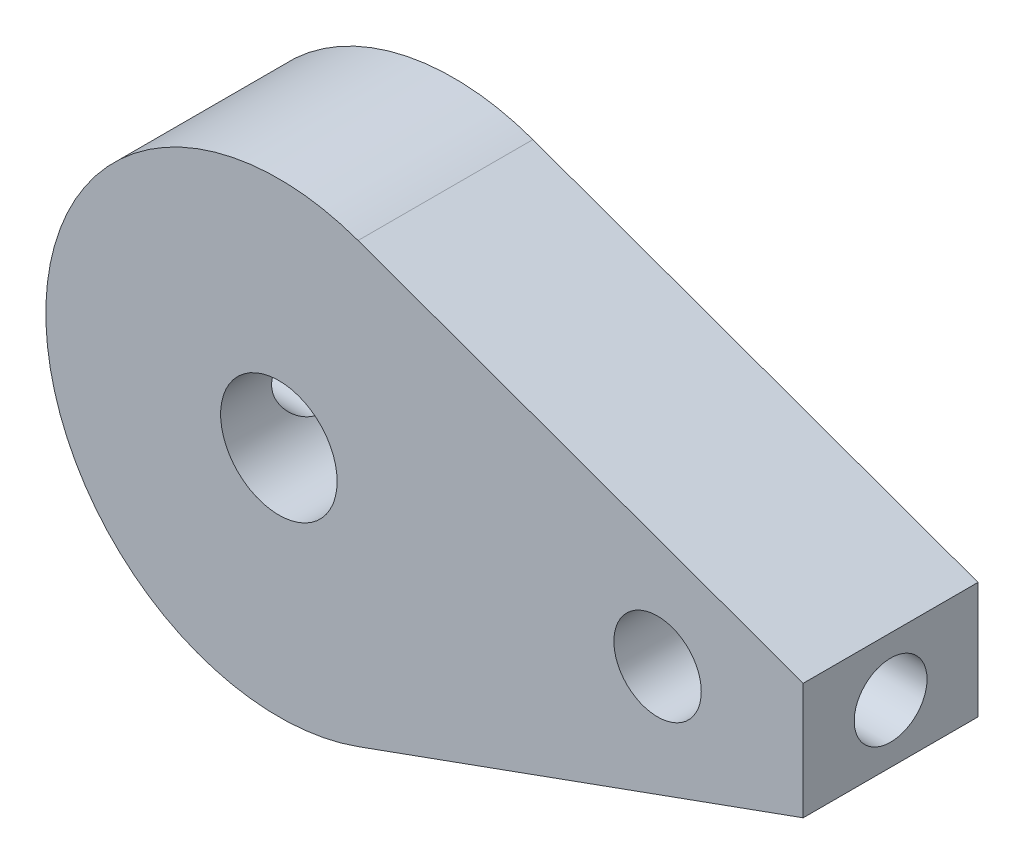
ISO-10303-21;
HEADER;
FILE_DESCRIPTION(('STEP AP214'),'2;1');
FILE_NAME('part.step','',(''),(''),'','','');
FILE_SCHEMA(('AUTOMOTIVE_DESIGN { 1 0 10303 214 1 1 1 1 }'));
ENDSEC;
DATA;
#1=APPLICATION_CONTEXT('core data for automotive mechanical design processes');
#2=APPLICATION_PROTOCOL_DEFINITION('international standard','automotive_design',2000,#1);
#3=PRODUCT_CONTEXT('',#1,'mechanical');
#4=PRODUCT('Part','Part','',(#3));
#5=PRODUCT_RELATED_PRODUCT_CATEGORY('part','',(#4));
#6=PRODUCT_DEFINITION_FORMATION('','',#4);
#7=PRODUCT_DEFINITION_CONTEXT('part definition',#1,'design');
#8=PRODUCT_DEFINITION('design','',#6,#7);
#9=PRODUCT_DEFINITION_SHAPE('','',#8);
#10=(LENGTH_UNIT() NAMED_UNIT(*) SI_UNIT(.MILLI.,.METRE.));
#11=(NAMED_UNIT(*) PLANE_ANGLE_UNIT() SI_UNIT($,.RADIAN.));
#12=(NAMED_UNIT(*) SI_UNIT($,.STERADIAN.) SOLID_ANGLE_UNIT());
#13=UNCERTAINTY_MEASURE_WITH_UNIT(LENGTH_MEASURE(1.E-05),#10,'distance_accuracy_value','');
#14=(GEOMETRIC_REPRESENTATION_CONTEXT(3) GLOBAL_UNCERTAINTY_ASSIGNED_CONTEXT((#13)) GLOBAL_UNIT_ASSIGNED_CONTEXT((#10,
#11,#12)) REPRESENTATION_CONTEXT('',''));
#15=CARTESIAN_POINT('',(0.,0.,0.));
#16=DIRECTION('',(0.,0.,1.));
#17=DIRECTION('',(1.,0.,0.));
#18=AXIS2_PLACEMENT_3D('',#15,#16,#17);
#19=CARTESIAN_POINT('',(-18.,0.,6.));
#20=DIRECTION('',(0.,0.,1.));
#21=DIRECTION('',(1.,0.,0.));
#22=AXIS2_PLACEMENT_3D('',#19,#20,#21);
#23=PLANE('',#22);
#24=CARTESIAN_POINT('',(-18.,0.,6.));
#25=DIRECTION('',(0.,0.,1.));
#26=DIRECTION('',(1.,0.,0.));
#27=AXIS2_PLACEMENT_3D('',#24,#25,#26);
#28=CIRCLE('',#27,2.);
#29=CARTESIAN_POINT('',(-16.,0.,6.));
#30=VERTEX_POINT('',#29);
#31=EDGE_CURVE('E104',#30,#30,#28,.T.);
#32=ORIENTED_EDGE('',*,*,#31,.F.);
#33=EDGE_LOOP('',(#32));
#34=FACE_BOUND('',#33,.T.);
#35=CARTESIAN_POINT('',(-18.,0.,6.));
#36=DIRECTION('',(0.,0.,1.));
#37=DIRECTION('',(1.,0.,0.));
#38=AXIS2_PLACEMENT_3D('',#35,#36,#37);
#39=CIRCLE('',#38,8.);
#40=CARTESIAN_POINT('',(-15.2803939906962,7.52354591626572,6.));
#41=VERTEX_POINT('',#40);
#42=CARTESIAN_POINT('',(-15.2803939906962,-7.52354591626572,6.));
#43=VERTEX_POINT('',#42);
#44=EDGE_CURVE('E89',#41,#43,#39,.T.);
#45=ORIENTED_EDGE('',*,*,#44,.T.);
#46=DIRECTION('',(0.940443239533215,0.339950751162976,0.));
#47=VECTOR('',#46,1.);
#48=CARTESIAN_POINT('',(0.,-2.,6.));
#49=LINE('',#48,#47);
#50=CARTESIAN_POINT('',(0.,-2.,6.));
#51=VERTEX_POINT('',#50);
#52=EDGE_CURVE('E84',#43,#51,#49,.T.);
#53=ORIENTED_EDGE('',*,*,#52,.T.);
#54=DIRECTION('',(0.,1.,0.));
#55=VECTOR('',#54,1.);
#56=CARTESIAN_POINT('',(0.,-2.,6.));
#57=LINE('',#56,#55);
#58=CARTESIAN_POINT('',(0.,2.,6.));
#59=VERTEX_POINT('',#58);
#60=EDGE_CURVE('E87',#51,#59,#57,.T.);
#61=ORIENTED_EDGE('',*,*,#60,.T.);
#62=DIRECTION('',(-0.940443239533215,0.339950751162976,0.));
#63=VECTOR('',#62,1.);
#64=CARTESIAN_POINT('',(0.,2.,6.));
#65=LINE('',#64,#63);
#66=EDGE_CURVE('E54',#59,#41,#65,.T.);
#67=ORIENTED_EDGE('',*,*,#66,.T.);
#68=EDGE_LOOP('',(#45,#53,#61,#67));
#69=FACE_BOUND('',#68,.T.);
#70=CARTESIAN_POINT('',(-5.,0.,6.));
#71=DIRECTION('',(0.,0.,1.));
#72=DIRECTION('',(1.,0.,0.));
#73=AXIS2_PLACEMENT_3D('',#70,#71,#72);
#74=CIRCLE('',#73,1.5);
#75=CARTESIAN_POINT('',(-3.5,0.,6.));
#76=VERTEX_POINT('',#75);
#77=EDGE_CURVE('E119',#76,#76,#74,.T.);
#78=ORIENTED_EDGE('',*,*,#77,.F.);
#79=EDGE_LOOP('',(#78));
#80=FACE_BOUND('',#79,.T.);
#81=ADVANCED_FACE('F36',(#34,#69,#80),#23,.T.);
#82=CARTESIAN_POINT('',(-18.,0.,0.));
#83=DIRECTION('',(0.,0.,1.));
#84=DIRECTION('',(1.,0.,0.));
#85=AXIS2_PLACEMENT_3D('',#82,#83,#84);
#86=PLANE('',#85);
#87=CARTESIAN_POINT('',(-18.,0.,0.));
#88=DIRECTION('',(0.,0.,1.));
#89=DIRECTION('',(1.,0.,0.));
#90=AXIS2_PLACEMENT_3D('',#87,#88,#89);
#91=CIRCLE('',#90,8.);
#92=CARTESIAN_POINT('',(-15.2803939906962,7.52354591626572,0.));
#93=VERTEX_POINT('',#92);
#94=CARTESIAN_POINT('',(-15.2803939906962,-7.52354591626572,0.));
#95=VERTEX_POINT('',#94);
#96=EDGE_CURVE('E101',#93,#95,#91,.T.);
#97=ORIENTED_EDGE('',*,*,#96,.F.);
#98=DIRECTION('',(-0.940443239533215,0.339950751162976,0.));
#99=VECTOR('',#98,1.);
#100=CARTESIAN_POINT('',(0.,2.,0.));
#101=LINE('',#100,#99);
#102=CARTESIAN_POINT('',(0.,2.,0.));
#103=VERTEX_POINT('',#102);
#104=EDGE_CURVE('E77',#103,#93,#101,.T.);
#105=ORIENTED_EDGE('',*,*,#104,.F.);
#106=DIRECTION('',(0.,1.,0.));
#107=VECTOR('',#106,1.);
#108=CARTESIAN_POINT('',(0.,-2.,0.));
#109=LINE('',#108,#107);
#110=CARTESIAN_POINT('',(0.,-2.,0.));
#111=VERTEX_POINT('',#110);
#112=EDGE_CURVE('E71',#111,#103,#109,.T.);
#113=ORIENTED_EDGE('',*,*,#112,.F.);
#114=DIRECTION('',(0.940443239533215,0.339950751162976,0.));
#115=VECTOR('',#114,1.);
#116=CARTESIAN_POINT('',(0.,-2.,0.));
#117=LINE('',#116,#115);
#118=EDGE_CURVE('E93',#95,#111,#117,.T.);
#119=ORIENTED_EDGE('',*,*,#118,.F.);
#120=EDGE_LOOP('',(#97,#105,#113,#119));
#121=FACE_BOUND('',#120,.T.);
#122=CARTESIAN_POINT('',(-18.,0.,0.));
#123=DIRECTION('',(0.,0.,1.));
#124=DIRECTION('',(1.,0.,0.));
#125=AXIS2_PLACEMENT_3D('',#122,#123,#124);
#126=CIRCLE('',#125,2.);
#127=CARTESIAN_POINT('',(-16.,0.,0.));
#128=VERTEX_POINT('',#127);
#129=EDGE_CURVE('E116',#128,#128,#126,.T.);
#130=ORIENTED_EDGE('',*,*,#129,.T.);
#131=EDGE_LOOP('',(#130));
#132=FACE_BOUND('',#131,.T.);
#133=CARTESIAN_POINT('',(-5.,0.,0.));
#134=DIRECTION('',(0.,0.,1.));
#135=DIRECTION('',(1.,0.,0.));
#136=AXIS2_PLACEMENT_3D('',#133,#134,#135);
#137=CIRCLE('',#136,1.5);
#138=CARTESIAN_POINT('',(-3.5,0.,0.));
#139=VERTEX_POINT('',#138);
#140=EDGE_CURVE('E122',#139,#139,#137,.T.);
#141=ORIENTED_EDGE('',*,*,#140,.T.);
#142=EDGE_LOOP('',(#141));
#143=FACE_BOUND('',#142,.T.);
#144=ADVANCED_FACE('F112',(#121,#132,#143),#86,.F.);
#145=CARTESIAN_POINT('',(-18.,0.,6.));
#146=DIRECTION('',(0.,0.,-1.));
#147=DIRECTION('',(-1.,0.,0.));
#148=AXIS2_PLACEMENT_3D('',#145,#146,#147);
#149=CYLINDRICAL_SURFACE('',#148,8.);
#150=CARTESIAN_POINT('',(-26.,0.,4.24999999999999));
#151=CARTESIAN_POINT('',(-25.9999988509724,-0.0697575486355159,4.24999715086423));
#152=CARTESIAN_POINT('',(-25.9990780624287,-0.139554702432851,4.24414094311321));
#153=CARTESIAN_POINT('',(-25.995493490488,-0.277195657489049,4.22087815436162));
#154=CARTESIAN_POINT('',(-25.9928280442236,-0.345037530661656,4.20346055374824));
#155=CARTESIAN_POINT('',(-25.9860534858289,-0.476756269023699,4.15761016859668));
#156=CARTESIAN_POINT('',(-25.9819454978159,-0.540636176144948,4.12918595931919));
#157=CARTESIAN_POINT('',(-25.9727389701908,-0.662710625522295,4.06215072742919));
#158=CARTESIAN_POINT('',(-25.9676405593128,-0.720905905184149,4.02354102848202));
#159=CARTESIAN_POINT('',(-25.9569713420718,-0.830459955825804,3.93688347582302));
#160=CARTESIAN_POINT('',(-25.9513972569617,-0.881763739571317,3.88876650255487));
#161=CARTESIAN_POINT('',(-25.9404303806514,-0.975603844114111,3.78460902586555));
#162=CARTESIAN_POINT('',(-25.9350376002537,-1.01813964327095,3.7285680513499));
#163=CARTESIAN_POINT('',(-25.9250121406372,-1.09345272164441,3.60978086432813));
#164=CARTESIAN_POINT('',(-25.9203836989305,-1.12617636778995,3.5470002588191));
#165=CARTESIAN_POINT('',(-25.9124560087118,-1.18059340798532,3.4167492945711));
#166=CARTESIAN_POINT('',(-25.9091566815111,-1.20228745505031,3.34927921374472));
#167=CARTESIAN_POINT('',(-25.9042931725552,-1.23385779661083,3.21214454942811));
#168=CARTESIAN_POINT('',(-25.9027151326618,-1.24382852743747,3.1425022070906));
#169=CARTESIAN_POINT('',(-25.9014308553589,-1.2519618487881,3.00251640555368));
#170=CARTESIAN_POINT('',(-25.9017245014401,-1.25012517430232,2.93217299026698));
#171=CARTESIAN_POINT('',(-25.904137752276,-1.23477290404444,2.79345148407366));
#172=CARTESIAN_POINT('',(-25.9062408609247,-1.22136281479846,2.72506138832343));
#173=CARTESIAN_POINT('',(-25.9120102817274,-1.18340968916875,2.59151399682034));
#174=CARTESIAN_POINT('',(-25.9156766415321,-1.15886631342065,2.52635679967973));
#175=CARTESIAN_POINT('',(-25.9241775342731,-1.09923458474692,2.40080564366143));
#176=CARTESIAN_POINT('',(-25.9290169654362,-1.06410186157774,2.34043310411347));
#177=CARTESIAN_POINT('',(-25.9393152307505,-0.98432029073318,2.22640023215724));
#178=CARTESIAN_POINT('',(-25.9447741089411,-0.939670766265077,2.17274037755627));
#179=CARTESIAN_POINT('',(-25.9557689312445,-0.841545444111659,2.07304487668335));
#180=CARTESIAN_POINT('',(-25.961305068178,-0.787979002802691,2.02709842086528));
#181=CARTESIAN_POINT('',(-25.9717756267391,-0.673848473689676,1.94483342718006));
#182=CARTESIAN_POINT('',(-25.9767100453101,-0.613284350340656,1.90851493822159));
#183=CARTESIAN_POINT('',(-25.9854269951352,-0.486797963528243,1.84653096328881));
#184=CARTESIAN_POINT('',(-25.9892087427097,-0.420872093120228,1.82087272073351));
#185=CARTESIAN_POINT('',(-25.9951878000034,-0.285574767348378,1.78101701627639));
#186=CARTESIAN_POINT('',(-25.9973852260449,-0.216203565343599,1.76681871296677));
#187=CARTESIAN_POINT('',(-25.9999325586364,-0.0767541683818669,1.75040536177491));
#188=CARTESIAN_POINT('',(-26.0003013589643,-0.00669073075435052,1.74806776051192));
#189=CARTESIAN_POINT('',(-25.9992014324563,0.132827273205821,1.755116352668));
#190=CARTESIAN_POINT('',(-25.9977327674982,0.202281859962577,1.76450215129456));
#191=CARTESIAN_POINT('',(-25.9931346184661,0.33823672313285,1.7946291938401));
#192=CARTESIAN_POINT('',(-25.9900139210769,0.404750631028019,1.81531037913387));
#193=CARTESIAN_POINT('',(-25.9824603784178,0.53336703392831,1.8673775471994));
#194=CARTESIAN_POINT('',(-25.9780274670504,0.5954693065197,1.89876406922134));
#195=CARTESIAN_POINT('',(-25.9682948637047,0.7140361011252,1.97163599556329));
#196=CARTESIAN_POINT('',(-25.9629886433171,0.770452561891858,2.01319871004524));
#197=CARTESIAN_POINT('',(-25.9521194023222,0.875553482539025,2.1051360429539));
#198=CARTESIAN_POINT('',(-25.9465563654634,0.924237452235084,2.15551121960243));
#199=CARTESIAN_POINT('',(-25.9357401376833,1.01294040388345,2.26419059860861));
#200=CARTESIAN_POINT('',(-25.930490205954,1.05287699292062,2.32256242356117));
#201=CARTESIAN_POINT('',(-25.9209534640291,1.1223778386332,2.44525803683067));
#202=CARTESIAN_POINT('',(-25.91666662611,1.15194239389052,2.50958165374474));
#203=CARTESIAN_POINT('',(-25.9095653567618,1.19973385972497,2.6421148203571));
#204=CARTESIAN_POINT('',(-25.9067454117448,1.21800327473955,2.71030873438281));
#205=CARTESIAN_POINT('',(-25.902882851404,1.24282061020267,2.84884457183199));
#206=CARTESIAN_POINT('',(-25.9018401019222,1.24936941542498,2.9191863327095));
#207=CARTESIAN_POINT('',(-25.9016552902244,1.25053726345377,3.05919935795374));
#208=CARTESIAN_POINT('',(-25.9024925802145,1.24528590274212,3.12886954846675));
#209=CARTESIAN_POINT('',(-25.9059284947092,1.2232811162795,3.26632264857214));
#210=CARTESIAN_POINT('',(-25.9085271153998,1.2065277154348,3.33410556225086));
#211=CARTESIAN_POINT('',(-25.9151854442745,1.16204164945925,3.46581891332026));
#212=CARTESIAN_POINT('',(-25.919243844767,1.1343188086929,3.5297527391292));
#213=CARTESIAN_POINT('',(-25.928365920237,1.06869384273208,3.65208280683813));
#214=CARTESIAN_POINT('',(-25.9334296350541,1.03079131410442,3.71047882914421));
#215=CARTESIAN_POINT('',(-25.9440578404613,0.945415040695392,3.82073277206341));
#216=CARTESIAN_POINT('',(-25.9496270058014,0.897845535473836,3.87251609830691));
#217=CARTESIAN_POINT('',(-25.9606002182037,0.794687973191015,3.96741061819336));
#218=CARTESIAN_POINT('',(-25.9660042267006,0.739098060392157,4.01051979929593));
#219=CARTESIAN_POINT('',(-25.9760755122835,0.621083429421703,4.08707561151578));
#220=CARTESIAN_POINT('',(-25.9807381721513,0.558619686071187,4.1204626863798));
#221=CARTESIAN_POINT('',(-25.9887562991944,0.428925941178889,4.17622049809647));
#222=CARTESIAN_POINT('',(-25.9921131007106,0.361700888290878,4.19860248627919));
#223=CARTESIAN_POINT('',(-25.9963872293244,0.245157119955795,4.22671651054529));
#224=CARTESIAN_POINT('',(-25.9977349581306,0.19655278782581,4.23543424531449));
#225=CARTESIAN_POINT('',(-25.9995417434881,0.0986388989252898,4.24707695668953));
#226=CARTESIAN_POINT('',(-26.0000008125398,0.0493293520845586,4.25000201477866));
#227=CARTESIAN_POINT('',(-26.,0.,4.24999999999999));
#228=B_SPLINE_CURVE_WITH_KNOTS('',3,(#150,#151,#152,#153,#154,#155,#156,#157,#158,#159,#160,
#161,#162,#163,#164,#165,#166,#167,#168,#169,#170,#171,#172,#173,#174,#175,#176,#177,#178,#179,
#180,#181,#182,#183,#184,#185,#186,#187,#188,#189,#190,#191,#192,#193,#194,#195,#196,#197,#198,
#199,#200,#201,#202,#203,#204,#205,#206,#207,#208,#209,#210,#211,#212,#213,#214,#215,#216,#217,
#218,#219,#220,#221,#222,#223,#224,#225,#226,#227),.UNSPECIFIED.,.T.,.F.,(4,2,2,2,2,2,2,2,2,2,2,
2,2,2,2,2,2,2,2,2,2,2,2,2,2,2,2,2,2,2,2,2,2,2,2,2,2,2,4),(0.,0.209092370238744,
0.418384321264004,0.62751353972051,0.836615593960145,1.04729784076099,1.2579926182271,
1.46981889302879,1.68163262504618,1.89172815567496,2.10181060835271,2.30999788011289,
2.51819149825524,2.72726988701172,2.93636314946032,3.14772866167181,3.35909524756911,
3.5706052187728,3.78209965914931,3.99140427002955,4.20070183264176,4.40889722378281,
4.61710310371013,4.82694270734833,5.03679560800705,5.24854740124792,5.46029309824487,
5.67123705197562,5.88216508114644,6.09078790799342,6.29941028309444,6.50784623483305,
6.7162904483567,6.92691006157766,7.13757848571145,7.34951152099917,7.56122742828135,
7.70909008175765,7.8569506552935),.UNSPECIFIED.);
#229=CARTESIAN_POINT('',(-26.,0.,4.24999999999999));
#230=VERTEX_POINT('',#229);
#231=EDGE_CURVE('E153',#230,#230,#228,.T.);
#232=ORIENTED_EDGE('',*,*,#231,.T.);
#233=EDGE_LOOP('',(#232));
#234=FACE_BOUND('',#233,.T.);
#235=ORIENTED_EDGE('',*,*,#96,.T.);
#236=DIRECTION('',(0.,0.,-1.));
#237=VECTOR('',#236,1.);
#238=CARTESIAN_POINT('',(-15.2803939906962,-7.52354591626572,6.));
#239=LINE('',#238,#237);
#240=EDGE_CURVE('E11',#43,#95,#239,.T.);
#241=ORIENTED_EDGE('',*,*,#240,.F.);
#242=ORIENTED_EDGE('',*,*,#44,.F.);
#243=DIRECTION('',(0.,0.,-1.));
#244=VECTOR('',#243,1.);
#245=CARTESIAN_POINT('',(-15.2803939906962,7.52354591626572,6.));
#246=LINE('',#245,#244);
#247=EDGE_CURVE('E97',#41,#93,#246,.T.);
#248=ORIENTED_EDGE('',*,*,#247,.T.);
#249=EDGE_LOOP('',(#235,#241,#242,#248));
#250=FACE_BOUND('',#249,.T.);
#251=ADVANCED_FACE('F38',(#234,#250),#149,.T.);
#252=CARTESIAN_POINT('',(0.,-2.,6.));
#253=DIRECTION('',(-0.339950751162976,0.940443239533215,0.));
#254=DIRECTION('',(-0.940443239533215,-0.339950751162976,0.));
#255=AXIS2_PLACEMENT_3D('',#252,#253,#254);
#256=PLANE('',#255);
#257=ORIENTED_EDGE('',*,*,#118,.T.);
#258=DIRECTION('',(0.,0.,-1.));
#259=VECTOR('',#258,1.);
#260=CARTESIAN_POINT('',(0.,-2.,6.));
#261=LINE('',#260,#259);
#262=EDGE_CURVE('E46',#51,#111,#261,.T.);
#263=ORIENTED_EDGE('',*,*,#262,.F.);
#264=ORIENTED_EDGE('',*,*,#52,.F.);
#265=ORIENTED_EDGE('',*,*,#240,.T.);
#266=EDGE_LOOP('',(#257,#263,#264,#265));
#267=FACE_BOUND('',#266,.T.);
#268=ADVANCED_FACE('F92',(#267),#256,.F.);
#269=CARTESIAN_POINT('',(0.,-2.,6.));
#270=DIRECTION('',(-1.,0.,0.));
#271=DIRECTION('',(0.,0.,1.));
#272=AXIS2_PLACEMENT_3D('',#269,#270,#271);
#273=PLANE('',#272);
#274=CARTESIAN_POINT('',(0.,0.,3.));
#275=DIRECTION('',(1.,0.,0.));
#276=DIRECTION('',(0.,0.,-1.));
#277=AXIS2_PLACEMENT_3D('',#274,#275,#276);
#278=CIRCLE('',#277,1.24999999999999);
#279=CARTESIAN_POINT('',(0.,0.,1.75000000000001));
#280=VERTEX_POINT('',#279);
#281=EDGE_CURVE('E134',#280,#280,#278,.T.);
#282=ORIENTED_EDGE('',*,*,#281,.F.);
#283=EDGE_LOOP('',(#282));
#284=FACE_BOUND('',#283,.T.);
#285=ORIENTED_EDGE('',*,*,#112,.T.);
#286=DIRECTION('',(0.,0.,-1.));
#287=VECTOR('',#286,1.);
#288=CARTESIAN_POINT('',(0.,2.,6.));
#289=LINE('',#288,#287);
#290=EDGE_CURVE('E94',#59,#103,#289,.T.);
#291=ORIENTED_EDGE('',*,*,#290,.F.);
#292=ORIENTED_EDGE('',*,*,#60,.F.);
#293=ORIENTED_EDGE('',*,*,#262,.T.);
#294=EDGE_LOOP('',(#285,#291,#292,#293));
#295=FACE_BOUND('',#294,.T.);
#296=ADVANCED_FACE('F95',(#284,#295),#273,.F.);
#297=CARTESIAN_POINT('',(0.,2.,6.));
#298=DIRECTION('',(-0.339950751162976,-0.940443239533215,0.));
#299=DIRECTION('',(0.940443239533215,-0.339950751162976,0.));
#300=AXIS2_PLACEMENT_3D('',#297,#298,#299);
#301=PLANE('',#300);
#302=ORIENTED_EDGE('',*,*,#104,.T.);
#303=ORIENTED_EDGE('',*,*,#247,.F.);
#304=ORIENTED_EDGE('',*,*,#66,.F.);
#305=ORIENTED_EDGE('',*,*,#290,.T.);
#306=EDGE_LOOP('',(#302,#303,#304,#305));
#307=FACE_BOUND('',#306,.T.);
#308=ADVANCED_FACE('F109',(#307),#301,.F.);
#309=CARTESIAN_POINT('',(-18.,0.,6.));
#310=DIRECTION('',(0.,0.,-1.));
#311=DIRECTION('',(-1.,0.,0.));
#312=AXIS2_PLACEMENT_3D('',#309,#310,#311);
#313=CYLINDRICAL_SURFACE('',#312,2.);
#314=CARTESIAN_POINT('',(-20.,0.,4.24999999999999));
#315=CARTESIAN_POINT('',(-19.9999959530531,-0.0635104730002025,4.24999565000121));
#316=CARTESIAN_POINT('',(-19.99694323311,-0.127096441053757,4.24512698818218));
#317=CARTESIAN_POINT('',(-19.985021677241,-0.252318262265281,4.22591419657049));
#318=CARTESIAN_POINT('',(-19.976141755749,-0.313950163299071,4.21155200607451));
#319=CARTESIAN_POINT('',(-19.9534585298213,-0.433205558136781,4.17418863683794));
#320=CARTESIAN_POINT('',(-19.9396796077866,-0.490847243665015,4.15123021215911));
#321=CARTESIAN_POINT('',(-19.9083459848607,-0.601260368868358,4.09761414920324));
#322=CARTESIAN_POINT('',(-19.8907917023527,-0.654032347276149,4.0669573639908));
#323=CARTESIAN_POINT('',(-19.8517015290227,-0.757974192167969,3.99611342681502));
#324=CARTESIAN_POINT('',(-19.8299596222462,-0.808679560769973,3.95536070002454));
#325=CARTESIAN_POINT('',(-19.7853134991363,-0.902986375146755,3.86678082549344));
#326=CARTESIAN_POINT('',(-19.7624077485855,-0.946578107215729,3.81894417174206));
#327=CARTESIAN_POINT('',(-19.714304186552,-1.03142873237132,3.70996610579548));
#328=CARTESIAN_POINT('',(-19.6892161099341,-1.0715720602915,3.64790021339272));
#329=CARTESIAN_POINT('',(-19.6433019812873,-1.14073966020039,3.51643518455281));
#330=CARTESIAN_POINT('',(-19.6224687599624,-1.16978270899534,3.44704868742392));
#331=CARTESIAN_POINT('',(-19.5930957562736,-1.2093340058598,3.32118947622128));
#332=CARTESIAN_POINT('',(-19.5827690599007,-1.22269552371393,3.26603318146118));
#333=CARTESIAN_POINT('',(-19.5678135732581,-1.24181843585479,3.1536940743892));
#334=CARTESIAN_POINT('',(-19.5631767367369,-1.24759056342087,3.09651424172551));
#335=CARTESIAN_POINT('',(-19.5602988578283,-1.25118918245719,2.98158698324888));
#336=CARTESIAN_POINT('',(-19.5620745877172,-1.2489948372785,2.9238384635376));
#337=CARTESIAN_POINT('',(-19.5717740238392,-1.23676317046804,2.80968989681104));
#338=CARTESIAN_POINT('',(-19.5797026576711,-1.22671956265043,2.75329096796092));
#339=CARTESIAN_POINT('',(-19.6003257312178,-1.19968103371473,2.64456154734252));
#340=CARTESIAN_POINT('',(-19.6129071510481,-1.18285016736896,2.59216754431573));
#341=CARTESIAN_POINT('',(-19.6414556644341,-1.14290189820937,2.49083881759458));
#342=CARTESIAN_POINT('',(-19.6574239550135,-1.11978227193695,2.4419053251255));
#343=CARTESIAN_POINT('',(-19.6945481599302,-1.06294892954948,2.33916672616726));
#344=CARTESIAN_POINT('',(-19.7161159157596,-1.0280629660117,2.28615918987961));
#345=CARTESIAN_POINT('',(-19.7600571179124,-0.950881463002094,2.18616972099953));
#346=CARTESIAN_POINT('',(-19.7824313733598,-0.908578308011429,2.13919406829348));
#347=CARTESIAN_POINT('',(-19.8297989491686,-0.809519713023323,2.04469825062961));
#348=CARTESIAN_POINT('',(-19.8546153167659,-0.751531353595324,1.99836702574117));
#349=CARTESIAN_POINT('',(-19.9002805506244,-0.62714809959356,1.91614910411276));
#350=CARTESIAN_POINT('',(-19.9211309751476,-0.56075652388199,1.88025830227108));
#351=CARTESIAN_POINT('',(-19.9555337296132,-0.42488356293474,1.82223631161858));
#352=CARTESIAN_POINT('',(-19.9694197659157,-0.355763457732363,1.79946596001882));
#353=CARTESIAN_POINT('',(-19.9898492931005,-0.213612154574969,1.76623507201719));
#354=CARTESIAN_POINT('',(-19.9964031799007,-0.140586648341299,1.755757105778));
#355=CARTESIAN_POINT('',(-20.0009784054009,-0.00451561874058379,1.74843414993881));
#356=CARTESIAN_POINT('',(-20.0001216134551,0.0584027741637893,1.74979682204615));
#357=CARTESIAN_POINT('',(-19.9925890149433,0.182972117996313,1.76188282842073));
#358=CARTESIAN_POINT('',(-19.9859136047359,0.244623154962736,1.77260552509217));
#359=CARTESIAN_POINT('',(-19.9677405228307,0.362521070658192,1.80223853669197));
#360=CARTESIAN_POINT('',(-19.9564417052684,0.418885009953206,1.82081215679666));
#361=CARTESIAN_POINT('',(-19.9299568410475,0.52763828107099,1.86529638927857));
#362=CARTESIAN_POINT('',(-19.9147701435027,0.580026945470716,1.89120823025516));
#363=CARTESIAN_POINT('',(-19.87990012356,0.685084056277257,1.95251520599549));
#364=CARTESIAN_POINT('',(-19.8599176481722,0.737246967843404,1.98860356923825));
#365=CARTESIAN_POINT('',(-19.8180697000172,0.835142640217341,2.06779386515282));
#366=CARTESIAN_POINT('',(-19.7962021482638,0.880868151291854,2.11090358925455));
#367=CARTESIAN_POINT('',(-19.7490586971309,0.971474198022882,2.21013503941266));
#368=CARTESIAN_POINT('',(-19.7237488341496,1.01526851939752,2.26723720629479));
#369=CARTESIAN_POINT('',(-19.6756676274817,1.09280351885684,2.38887578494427));
#370=CARTESIAN_POINT('',(-19.6528945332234,1.12655115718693,2.453407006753));
#371=CARTESIAN_POINT('',(-19.6173353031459,1.17684772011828,2.57469214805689));
#372=CARTESIAN_POINT('',(-19.6034563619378,1.19551895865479,2.63024075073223));
#373=CARTESIAN_POINT('',(-19.5810503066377,1.22500108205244,2.74439314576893));
#374=CARTESIAN_POINT('',(-19.5725148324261,1.23582424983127,2.80299200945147));
#375=CARTESIAN_POINT('',(-19.5620632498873,1.24901383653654,2.9220902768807));
#376=CARTESIAN_POINT('',(-19.5601850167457,1.25133186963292,2.98259858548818));
#377=CARTESIAN_POINT('',(-19.5634906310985,1.24719778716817,3.10313096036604));
#378=CARTESIAN_POINT('',(-19.5686768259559,1.24074275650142,3.16315485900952));
#379=CARTESIAN_POINT('',(-19.5845538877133,1.22038272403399,3.27602979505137));
#380=CARTESIAN_POINT('',(-19.5947680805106,1.20711919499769,3.32906930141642));
#381=CARTESIAN_POINT('',(-19.6191753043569,1.17417623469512,3.43213505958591));
#382=CARTESIAN_POINT('',(-19.6333699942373,1.15449412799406,3.48216004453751));
#383=CARTESIAN_POINT('',(-19.6666390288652,1.10602690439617,3.5855967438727));
#384=CARTESIAN_POINT('',(-19.68612230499,1.07633644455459,3.63845029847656));
#385=CARTESIAN_POINT('',(-19.7266770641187,1.01000017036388,3.73893836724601));
#386=CARTESIAN_POINT('',(-19.7477498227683,0.973348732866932,3.78656861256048));
#387=CARTESIAN_POINT('',(-19.7940191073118,0.885670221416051,3.88501425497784));
#388=CARTESIAN_POINT('',(-19.8192054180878,0.833233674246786,3.93459084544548));
#389=CARTESIAN_POINT('',(-19.8669872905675,0.719822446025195,4.02449482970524));
#390=CARTESIAN_POINT('',(-19.8895812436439,0.65884251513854,4.0648164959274));
#391=CARTESIAN_POINT('',(-19.9298671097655,0.529355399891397,4.1347711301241));
#392=CARTESIAN_POINT('',(-19.9475507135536,0.46083572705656,4.16438600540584));
#393=CARTESIAN_POINT('',(-19.9758152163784,0.31839471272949,4.21107188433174));
#394=CARTESIAN_POINT('',(-19.9864212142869,0.244493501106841,4.22818723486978));
#395=CARTESIAN_POINT('',(-19.9951947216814,0.141418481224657,4.24229920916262));
#396=CARTESIAN_POINT('',(-19.996991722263,0.113248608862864,4.24518186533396));
#397=CARTESIAN_POINT('',(-19.9993953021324,0.0567241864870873,4.2490332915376));
#398=CARTESIAN_POINT('',(-20.0000018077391,0.0283696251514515,4.25000194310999));
#399=CARTESIAN_POINT('',(-20.,0.,4.24999999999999));
#400=B_SPLINE_CURVE_WITH_KNOTS('',3,(#314,#315,#316,#317,#318,#319,#320,#321,#322,#323,#324,
#325,#326,#327,#328,#329,#330,#331,#332,#333,#334,#335,#336,#337,#338,#339,#340,#341,#342,#343,
#344,#345,#346,#347,#348,#349,#350,#351,#352,#353,#354,#355,#356,#357,#358,#359,#360,#361,#362,
#363,#364,#365,#366,#367,#368,#369,#370,#371,#372,#373,#374,#375,#376,#377,#378,#379,#380,#381,
#382,#383,#384,#385,#386,#387,#388,#389,#390,#391,#392,#393,#394,#395,#396,#397,#398,#399),
.UNSPECIFIED.,.T.,.F.,(4,2,2,2,2,2,2,2,2,2,2,2,2,2,2,2,2,2,2,2,2,2,2,2,2,2,2,2,2,2,2,2,2,2,2,2,
2,2,2,2,2,2,4),(0.,0.190412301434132,0.38118789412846,0.571026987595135,0.760845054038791,
0.965821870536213,1.17107628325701,1.40412975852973,1.6367872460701,1.80912008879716,
1.9812089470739,2.15374823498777,2.32642584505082,2.49515839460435,2.66395067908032,
2.86427450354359,3.06480522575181,3.2984218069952,3.5319464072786,3.75284174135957,
3.97342347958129,4.16127180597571,4.34910733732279,4.52959504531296,4.71011298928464,
4.9088523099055,5.10781368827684,5.33565708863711,5.56334227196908,5.74329940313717,
5.9229742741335,6.10366974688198,6.28442527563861,6.45063169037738,6.61690747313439,
6.80725523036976,6.99775741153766,7.22600539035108,7.45439424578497,7.68316725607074,
7.91112460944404,7.99617501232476,8.08123067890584),.UNSPECIFIED.);
#401=CARTESIAN_POINT('',(-20.,0.,4.24999999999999));
#402=VERTEX_POINT('',#401);
#403=EDGE_CURVE('E149',#402,#402,#400,.T.);
#404=ORIENTED_EDGE('',*,*,#403,.F.);
#405=EDGE_LOOP('',(#404));
#406=FACE_BOUND('',#405,.T.);
#407=ORIENTED_EDGE('',*,*,#31,.T.);
#408=EDGE_LOOP('',(#407));
#409=FACE_BOUND('',#408,.T.);
#410=ORIENTED_EDGE('',*,*,#129,.F.);
#411=EDGE_LOOP('',(#410));
#412=FACE_BOUND('',#411,.T.);
#413=ADVANCED_FACE('F169',(#406,#409,#412),#313,.F.);
#414=CARTESIAN_POINT('',(-5.,0.,6.));
#415=DIRECTION('',(0.,0.,-1.));
#416=DIRECTION('',(-1.,0.,0.));
#417=AXIS2_PLACEMENT_3D('',#414,#415,#416);
#418=CYLINDRICAL_SURFACE('',#417,1.5);
#419=CARTESIAN_POINT('',(-3.5,0.,1.75000000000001));
#420=CARTESIAN_POINT('',(-3.50000239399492,-0.0593787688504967,1.75000244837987));
#421=CARTESIAN_POINT('',(-3.50355666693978,-0.118775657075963,1.75426126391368));
#422=CARTESIAN_POINT('',(-3.51744616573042,-0.235591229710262,1.77098134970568));
#423=CARTESIAN_POINT('',(-3.52778641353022,-0.293008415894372,1.78344869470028));
#424=CARTESIAN_POINT('',(-3.55428662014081,-0.40391503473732,1.81565610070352));
#425=CARTESIAN_POINT('',(-3.57041178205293,-0.457425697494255,1.83535269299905));
#426=CARTESIAN_POINT('',(-3.60735385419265,-0.559920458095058,1.8810083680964));
#427=CARTESIAN_POINT('',(-3.62817234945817,-0.608903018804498,1.90696956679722));
#428=CARTESIAN_POINT('',(-3.68163039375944,-0.718951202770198,1.97472767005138));
#429=CARTESIAN_POINT('',(-3.71580315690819,-0.777846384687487,2.01883857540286));
#430=CARTESIAN_POINT('',(-3.78788095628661,-0.886006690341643,2.11525867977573));
#431=CARTESIAN_POINT('',(-3.82579623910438,-0.935244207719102,2.1675906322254));
#432=CARTESIAN_POINT('',(-3.9030045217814,-1.02476981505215,2.28052433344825));
#433=CARTESIAN_POINT('',(-3.94231003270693,-1.06487540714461,2.3412612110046));
#434=CARTESIAN_POINT('',(-4.01752662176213,-1.13460946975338,2.4703506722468));
#435=CARTESIAN_POINT('',(-4.05344743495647,-1.16426870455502,2.53868010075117));
#436=CARTESIAN_POINT('',(-4.10103329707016,-1.20096809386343,2.65084767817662));
#437=CARTESIAN_POINT('',(-4.11631654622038,-1.21216917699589,2.69176584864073));
#438=CARTESIAN_POINT('',(-4.14203599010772,-1.23050643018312,2.77594109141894));
#439=CARTESIAN_POINT('',(-4.15248393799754,-1.23765246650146,2.81919220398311));
#440=CARTESIAN_POINT('',(-4.16689486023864,-1.24740539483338,2.90788380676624));
#441=CARTESIAN_POINT('',(-4.17077739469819,-1.24995600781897,2.9533445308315));
#442=CARTESIAN_POINT('',(-4.17090850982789,-1.25004286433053,3.04428075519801));
#443=CARTESIAN_POINT('',(-4.16715699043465,-1.24757904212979,3.08975625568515));
#444=CARTESIAN_POINT('',(-4.15229211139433,-1.23752620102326,3.18276354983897));
#445=CARTESIAN_POINT('',(-4.14059168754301,-1.22952745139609,3.2301512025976));
#446=CARTESIAN_POINT('',(-4.11155746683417,-1.20871318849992,3.32210114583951));
#447=CARTESIAN_POINT('',(-4.09420500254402,-1.19588169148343,3.36665348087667));
#448=CARTESIAN_POINT('',(-4.04486086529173,-1.15722563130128,3.47810439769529));
#449=CARTESIAN_POINT('',(-4.01026545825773,-1.1281992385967,3.54271488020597));
#450=CARTESIAN_POINT('',(-3.93823637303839,-1.06071724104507,3.66502873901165));
#451=CARTESIAN_POINT('',(-3.9007977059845,-1.02224478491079,3.72271949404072));
#452=CARTESIAN_POINT('',(-3.82461504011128,-0.933838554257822,3.83412041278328));
#453=CARTESIAN_POINT('',(-3.785904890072,-0.883411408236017,3.88746569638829));
#454=CARTESIAN_POINT('',(-3.71245088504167,-0.77241956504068,3.98555963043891));
#455=CARTESIAN_POINT('',(-3.67769854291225,-0.711877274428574,4.03032682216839));
#456=CARTESIAN_POINT('',(-3.6228561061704,-0.597056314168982,4.0997068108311));
#457=CARTESIAN_POINT('',(-3.6012584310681,-0.544863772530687,4.12657128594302));
#458=CARTESIAN_POINT('',(-3.56346079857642,-0.435535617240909,4.1731715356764));
#459=CARTESIAN_POINT('',(-3.54725747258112,-0.378403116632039,4.19291175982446));
#460=CARTESIAN_POINT('',(-3.52145087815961,-0.259977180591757,4.22420858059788));
#461=CARTESIAN_POINT('',(-3.5118986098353,-0.198655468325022,4.23570196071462));
#462=CARTESIAN_POINT('',(-3.50054281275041,-0.0742799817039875,4.24935462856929));
#463=CARTESIAN_POINT('',(-3.49873409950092,-0.0112273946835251,4.25152016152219));
#464=CARTESIAN_POINT('',(-3.50277501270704,0.106655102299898,4.24666877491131));
#465=CARTESIAN_POINT('',(-3.5077332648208,0.161565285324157,4.24072067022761));
#466=CARTESIAN_POINT('',(-3.52337203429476,0.269322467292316,4.22186653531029));
#467=CARTESIAN_POINT('',(-3.53405323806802,0.322169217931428,4.20895967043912));
#468=CARTESIAN_POINT('',(-3.56055245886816,0.42528280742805,4.17668826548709));
#469=CARTESIAN_POINT('',(-3.57643742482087,0.475505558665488,4.15723946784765));
#470=CARTESIAN_POINT('',(-3.61231912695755,0.571829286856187,4.1128023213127));
#471=CARTESIAN_POINT('',(-3.63231738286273,0.617928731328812,4.08781192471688));
#472=CARTESIAN_POINT('',(-3.68512558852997,0.725338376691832,4.02078335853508));
#473=CARTESIAN_POINT('',(-3.71965486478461,0.784177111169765,3.97613035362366));
#474=CARTESIAN_POINT('',(-3.79238166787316,0.892139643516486,3.87858317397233));
#475=CARTESIAN_POINT('',(-3.83059039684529,0.941232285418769,3.82566350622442));
#476=CARTESIAN_POINT('',(-3.90823568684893,1.03033901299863,3.71151204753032));
#477=CARTESIAN_POINT('',(-3.94768196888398,1.07017375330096,3.65014776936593));
#478=CARTESIAN_POINT('',(-4.02289413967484,1.13922410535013,3.51970741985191));
#479=CARTESIAN_POINT('',(-4.05867178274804,1.1684744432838,3.45065755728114));
#480=CARTESIAN_POINT('',(-4.10536481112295,1.20418713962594,3.33785101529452));
#481=CARTESIAN_POINT('',(-4.12014446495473,1.21494166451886,3.2970790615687));
#482=CARTESIAN_POINT('',(-4.14478665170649,1.23241118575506,3.21327772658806));
#483=CARTESIAN_POINT('',(-4.15466145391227,1.23913627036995,3.17025427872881));
#484=CARTESIAN_POINT('',(-4.16792290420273,1.24808646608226,3.08218011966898));
#485=CARTESIAN_POINT('',(-4.17123368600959,1.25025897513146,3.03711179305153));
#486=CARTESIAN_POINT('',(-4.17037851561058,1.24969100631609,2.94707393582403));
#487=CARTESIAN_POINT('',(-4.16621059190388,1.24694923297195,2.90210443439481));
#488=CARTESIAN_POINT('',(-4.15053581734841,1.23632620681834,2.80916250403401));
#489=CARTESIAN_POINT('',(-4.13829452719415,1.2279286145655,2.76138043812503));
#490=CARTESIAN_POINT('',(-4.10820497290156,1.20625214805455,2.66873879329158));
#491=CARTESIAN_POINT('',(-4.09033819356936,1.19295712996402,2.62388946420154));
#492=CARTESIAN_POINT('',(-4.03970661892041,1.1529905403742,2.51165820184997));
#493=CARTESIAN_POINT('',(-4.00437642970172,1.12305667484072,2.44661867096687));
#494=CARTESIAN_POINT('',(-3.93106891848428,1.05354944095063,2.32359036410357));
#495=CARTESIAN_POINT('',(-3.8930870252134,1.01395911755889,2.26561426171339));
#496=CARTESIAN_POINT('',(-3.81615174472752,0.923157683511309,2.15400924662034));
#497=CARTESIAN_POINT('',(-3.77724194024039,0.871472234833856,2.10073251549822));
#498=CARTESIAN_POINT('',(-3.70371360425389,0.757765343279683,2.00306469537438));
#499=CARTESIAN_POINT('',(-3.66908563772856,0.695767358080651,1.95865393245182));
#500=CARTESIAN_POINT('',(-3.61528913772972,0.579278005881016,1.89084348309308));
#501=CARTESIAN_POINT('',(-3.59443930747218,0.526999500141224,1.86498089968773));
#502=CARTESIAN_POINT('',(-3.55819251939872,0.417719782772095,1.82039051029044));
#503=CARTESIAN_POINT('',(-3.54278829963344,0.360724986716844,1.80165319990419));
#504=CARTESIAN_POINT('',(-3.52070630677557,0.25331004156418,1.77490580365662));
#505=CARTESIAN_POINT('',(-3.51298929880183,0.203422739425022,1.76561244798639));
#506=CARTESIAN_POINT('',(-3.50263537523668,0.102361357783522,1.75315880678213));
#507=CARTESIAN_POINT('',(-3.49999793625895,0.0511874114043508,1.74999788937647));
#508=CARTESIAN_POINT('',(-3.5,0.,1.75000000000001));
#509=B_SPLINE_CURVE_WITH_KNOTS('',3,(#419,#420,#421,#422,#423,#424,#425,#426,#427,#428,#429,
#430,#431,#432,#433,#434,#435,#436,#437,#438,#439,#440,#441,#442,#443,#444,#445,#446,#447,#448,
#449,#450,#451,#452,#453,#454,#455,#456,#457,#458,#459,#460,#461,#462,#463,#464,#465,#466,#467,
#468,#469,#470,#471,#472,#473,#474,#475,#476,#477,#478,#479,#480,#481,#482,#483,#484,#485,#486,
#487,#488,#489,#490,#491,#492,#493,#494,#495,#496,#497,#498,#499,#500,#501,#502,#503,#504,#505,
#506,#507,#508),.UNSPECIFIED.,.T.,.F.,(4,2,2,2,2,2,2,2,2,2,2,2,2,2,2,2,2,2,2,2,2,2,2,2,2,2,2,2,
2,2,2,2,2,2,2,2,2,2,2,2,2,2,2,2,4),(0.,0.177920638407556,0.355973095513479,0.532972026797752,
0.710030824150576,0.952125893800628,1.19490321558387,1.4421737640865,1.68870989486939,
1.82361318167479,1.95818681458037,2.0943976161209,2.23061020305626,2.37816635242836,
2.52621487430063,2.76143398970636,2.9970758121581,3.24501566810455,3.49241341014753,
3.67933989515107,3.86614943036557,4.0543760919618,4.24247671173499,4.40804641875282,
4.57363598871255,4.74144560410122,4.90931733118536,5.152610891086,5.39667010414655,
5.64512295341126,5.89275310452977,6.02641745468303,6.15974574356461,6.29460624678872,
6.42950230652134,6.57876724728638,6.72852869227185,6.96677041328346,7.20543349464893,
7.45579032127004,7.70558526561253,7.89070171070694,8.07557035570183,8.22896247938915,
8.38233879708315),.UNSPECIFIED.);
#510=CARTESIAN_POINT('',(-3.5,0.,1.75000000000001));
#511=VERTEX_POINT('',#510);
#512=EDGE_CURVE('E125',#511,#511,#509,.T.);
#513=ORIENTED_EDGE('',*,*,#512,.F.);
#514=EDGE_LOOP('',(#513));
#515=FACE_BOUND('',#514,.T.);
#516=ORIENTED_EDGE('',*,*,#77,.T.);
#517=EDGE_LOOP('',(#516));
#518=FACE_BOUND('',#517,.T.);
#519=ORIENTED_EDGE('',*,*,#140,.F.);
#520=EDGE_LOOP('',(#519));
#521=FACE_BOUND('',#520,.T.);
#522=ADVANCED_FACE('F143',(#515,#518,#521),#418,.F.);
#523=CARTESIAN_POINT('',(0.,0.,3.));
#524=DIRECTION('',(1.,0.,0.));
#525=DIRECTION('',(0.,0.,-1.));
#526=AXIS2_PLACEMENT_3D('',#523,#524,#525);
#527=CYLINDRICAL_SURFACE('',#526,1.24999999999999);
#528=ORIENTED_EDGE('',*,*,#281,.T.);
#529=EDGE_LOOP('',(#528));
#530=FACE_BOUND('',#529,.T.);
#531=ORIENTED_EDGE('',*,*,#512,.T.);
#532=EDGE_LOOP('',(#531));
#533=FACE_BOUND('',#532,.T.);
#534=ADVANCED_FACE('F138',(#530,#533),#527,.F.);
#535=CARTESIAN_POINT('',(-26.,0.,3.));
#536=DIRECTION('',(-1.,0.,0.));
#537=DIRECTION('',(0.,0.,1.));
#538=AXIS2_PLACEMENT_3D('',#535,#536,#537);
#539=CYLINDRICAL_SURFACE('',#538,1.24999999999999);
#540=ORIENTED_EDGE('',*,*,#403,.T.);
#541=EDGE_LOOP('',(#540));
#542=FACE_BOUND('',#541,.T.);
#543=ORIENTED_EDGE('',*,*,#231,.F.);
#544=EDGE_LOOP('',(#543));
#545=FACE_BOUND('',#544,.T.);
#546=ADVANCED_FACE('F142',(#542,#545),#539,.F.);
#547=CLOSED_SHELL('',(#81,#144,#251,#268,#296,#308,#413,#522,#534,#546));
#548=MANIFOLD_SOLID_BREP('B2',#547);
#549=ADVANCED_BREP_SHAPE_REPRESENTATION('',(#18,#548),#14);
#550=SHAPE_DEFINITION_REPRESENTATION(#9,#549);
ENDSEC;
END-ISO-10303-21;
